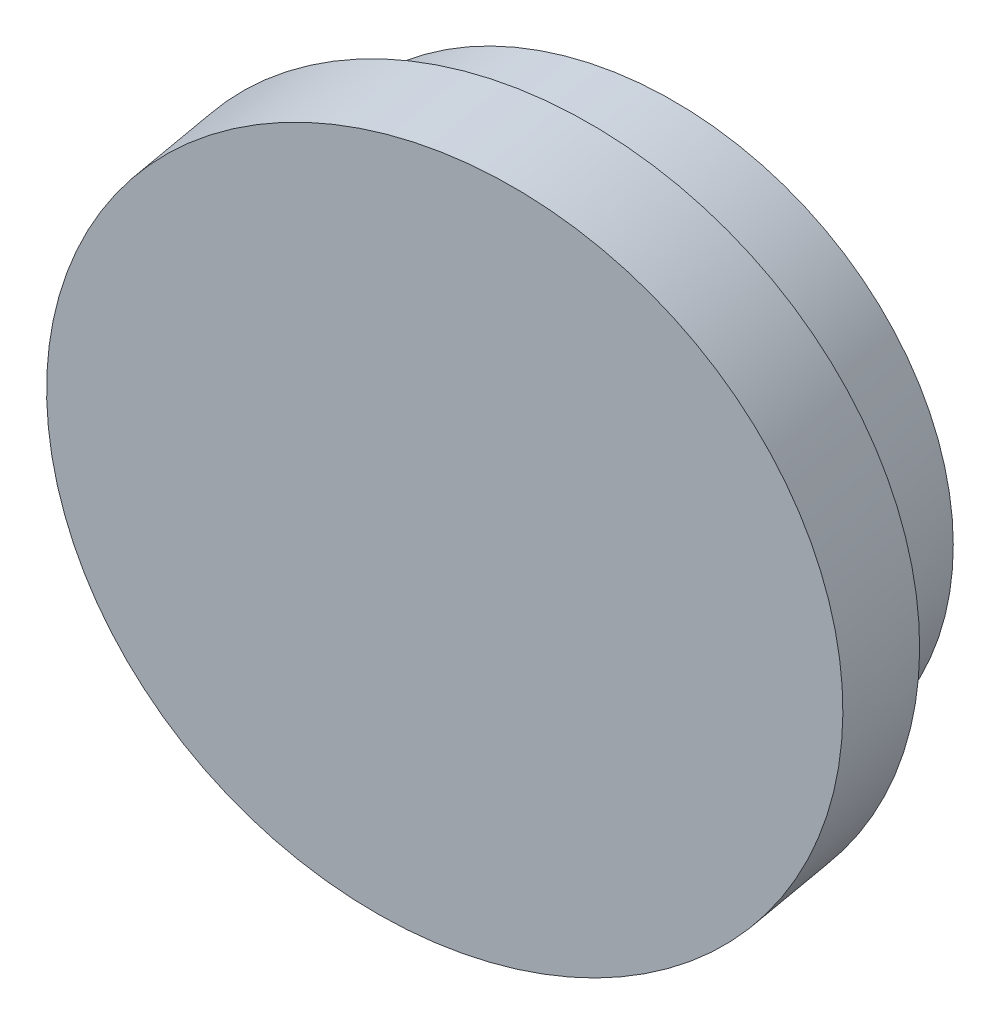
ISO-10303-21;
HEADER;
FILE_DESCRIPTION(('STEP AP214'),'2;1');
FILE_NAME('part.step','',(''),(''),'','','');
FILE_SCHEMA(('AUTOMOTIVE_DESIGN { 1 0 10303 214 1 1 1 1 }'));
ENDSEC;
DATA;
#1=APPLICATION_CONTEXT('core data for automotive mechanical design processes');
#2=APPLICATION_PROTOCOL_DEFINITION('international standard','automotive_design',2000,#1);
#3=PRODUCT_CONTEXT('',#1,'mechanical');
#4=PRODUCT('Part','Part','',(#3));
#5=PRODUCT_RELATED_PRODUCT_CATEGORY('part','',(#4));
#6=PRODUCT_DEFINITION_FORMATION('','',#4);
#7=PRODUCT_DEFINITION_CONTEXT('part definition',#1,'design');
#8=PRODUCT_DEFINITION('design','',#6,#7);
#9=PRODUCT_DEFINITION_SHAPE('','',#8);
#10=(LENGTH_UNIT() NAMED_UNIT(*) SI_UNIT(.MILLI.,.METRE.));
#11=(NAMED_UNIT(*) PLANE_ANGLE_UNIT() SI_UNIT($,.RADIAN.));
#12=(NAMED_UNIT(*) SI_UNIT($,.STERADIAN.) SOLID_ANGLE_UNIT());
#13=UNCERTAINTY_MEASURE_WITH_UNIT(LENGTH_MEASURE(1.E-05),#10,'distance_accuracy_value','');
#14=(GEOMETRIC_REPRESENTATION_CONTEXT(3) GLOBAL_UNCERTAINTY_ASSIGNED_CONTEXT((#13)) GLOBAL_UNIT_ASSIGNED_CONTEXT((#10,
#11,#12)) REPRESENTATION_CONTEXT('',''));
#15=CARTESIAN_POINT('',(0.,0.,0.));
#16=DIRECTION('',(0.,0.,1.));
#17=DIRECTION('',(1.,0.,0.));
#18=AXIS2_PLACEMENT_3D('',#15,#16,#17);
#19=CARTESIAN_POINT('',(-394.670757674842,1001.73036723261,1.25049673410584));
#20=DIRECTION('',(-0.174497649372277,0.,-0.984657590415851));
#21=DIRECTION('',(-0.940172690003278,-0.297178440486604,0.166614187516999));
#22=AXIS2_PLACEMENT_3D('',#19,#20,#21);
#23=PLANE('',#22);
#24=CARTESIAN_POINT('',(-394.670757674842,1001.73036723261,1.25049673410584));
#25=DIRECTION('',(-0.174497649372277,0.,-0.984657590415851));
#26=DIRECTION('',(-0.940172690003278,-0.297178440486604,0.166614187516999));
#27=AXIS2_PLACEMENT_3D('',#24,#25,#26);
#28=CIRCLE('',#27,72.5);
#29=CARTESIAN_POINT('',(-462.83327770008,980.184930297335,13.3300253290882));
#30=VERTEX_POINT('',#29);
#31=EDGE_CURVE('E10',#30,#30,#28,.T.);
#32=ORIENTED_EDGE('',*,*,#31,.T.);
#33=EDGE_LOOP('',(#32));
#34=FACE_BOUND('',#33,.T.);
#35=CARTESIAN_POINT('',(-394.670757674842,1001.73036723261,1.25049673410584));
#36=DIRECTION('',(-0.174497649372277,0.,-0.984657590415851));
#37=DIRECTION('',(-0.940172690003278,-0.297178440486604,0.166614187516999));
#38=AXIS2_PLACEMENT_3D('',#35,#36,#37);
#39=CIRCLE('',#38,61.5);
#40=CARTESIAN_POINT('',(-452.491378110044,983.453893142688,11.4972692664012));
#41=VERTEX_POINT('',#40);
#42=EDGE_CURVE('E33',#41,#41,#39,.T.);
#43=ORIENTED_EDGE('',*,*,#42,.F.);
#44=EDGE_LOOP('',(#43));
#45=FACE_BOUND('',#44,.T.);
#46=ADVANCED_FACE('F15',(#34,#45),#23,.T.);
#47=CARTESIAN_POINT('',(-394.670757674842,1001.73036723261,1.25049673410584));
#48=DIRECTION('',(0.174497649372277,0.,0.984657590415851));
#49=DIRECTION('',(0.940172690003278,0.297178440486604,-0.166614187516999));
#50=AXIS2_PLACEMENT_3D('',#47,#48,#49);
#51=CYLINDRICAL_SURFACE('',#50,72.5);
#52=ORIENTED_EDGE('',*,*,#31,.F.);
#53=EDGE_LOOP('',(#52));
#54=FACE_BOUND('',#53,.T.);
#55=CARTESIAN_POINT('',(-391.180804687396,1001.73036723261,20.9436485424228));
#56=DIRECTION('',(-0.174497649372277,0.,-0.984657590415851));
#57=DIRECTION('',(-0.940172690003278,-0.297178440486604,0.166614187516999));
#58=AXIS2_PLACEMENT_3D('',#55,#56,#57);
#59=CIRCLE('',#58,72.5);
#60=CARTESIAN_POINT('',(-459.343324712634,980.184930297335,33.0231771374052));
#61=VERTEX_POINT('',#60);
#62=EDGE_CURVE('E19',#61,#61,#59,.T.);
#63=ORIENTED_EDGE('',*,*,#62,.T.);
#64=EDGE_LOOP('',(#63));
#65=FACE_BOUND('',#64,.T.);
#66=ADVANCED_FACE('F17',(#54,#65),#51,.T.);
#67=CARTESIAN_POINT('',(-391.180804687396,1001.73036723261,20.9436485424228));
#68=DIRECTION('',(-0.174497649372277,0.,-0.984657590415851));
#69=DIRECTION('',(-0.940172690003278,-0.297178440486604,0.166614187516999));
#70=AXIS2_PLACEMENT_3D('',#67,#68,#69);
#71=PLANE('',#70);
#72=ORIENTED_EDGE('',*,*,#62,.F.);
#73=EDGE_LOOP('',(#72));
#74=FACE_BOUND('',#73,.T.);
#75=ADVANCED_FACE('F46',(#74),#71,.F.);
#76=CARTESIAN_POINT('',(-398.945950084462,1001.73036723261,-22.8736142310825));
#77=DIRECTION('',(0.174497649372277,0.,0.984657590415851));
#78=DIRECTION('',(0.940172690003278,0.297178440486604,-0.166614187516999));
#79=AXIS2_PLACEMENT_3D('',#76,#77,#78);
#80=CYLINDRICAL_SURFACE('',#79,61.5);
#81=CARTESIAN_POINT('',(-398.945950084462,1001.73036723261,-22.8736142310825));
#82=DIRECTION('',(-0.174497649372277,0.,-0.984657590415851));
#83=DIRECTION('',(-0.940172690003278,-0.297178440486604,0.166614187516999));
#84=AXIS2_PLACEMENT_3D('',#81,#82,#83);
#85=CIRCLE('',#84,61.5);
#86=CARTESIAN_POINT('',(-456.766570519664,983.453893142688,-12.6268416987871));
#87=VERTEX_POINT('',#86);
#88=EDGE_CURVE('E31',#87,#87,#85,.T.);
#89=ORIENTED_EDGE('',*,*,#88,.F.);
#90=EDGE_LOOP('',(#89));
#91=FACE_BOUND('',#90,.T.);
#92=ORIENTED_EDGE('',*,*,#42,.T.);
#93=EDGE_LOOP('',(#92));
#94=FACE_BOUND('',#93,.T.);
#95=ADVANCED_FACE('F43',(#91,#94),#80,.T.);
#96=CARTESIAN_POINT('',(-398.945950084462,1001.73036723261,-22.8736142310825));
#97=DIRECTION('',(-0.174497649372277,0.,-0.984657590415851));
#98=DIRECTION('',(-0.940172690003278,-0.297178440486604,0.166614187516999));
#99=AXIS2_PLACEMENT_3D('',#96,#97,#98);
#100=PLANE('',#99);
#101=ORIENTED_EDGE('',*,*,#88,.T.);
#102=EDGE_LOOP('',(#101));
#103=FACE_BOUND('',#102,.T.);
#104=ADVANCED_FACE('F41',(#103),#100,.T.);
#105=CLOSED_SHELL('',(#46,#66,#75,#95,#104));
#106=MANIFOLD_SOLID_BREP('B1',#105);
#107=ADVANCED_BREP_SHAPE_REPRESENTATION('',(#18,#106),#14);
#108=SHAPE_DEFINITION_REPRESENTATION(#9,#107);
ENDSEC;
END-ISO-10303-21;
